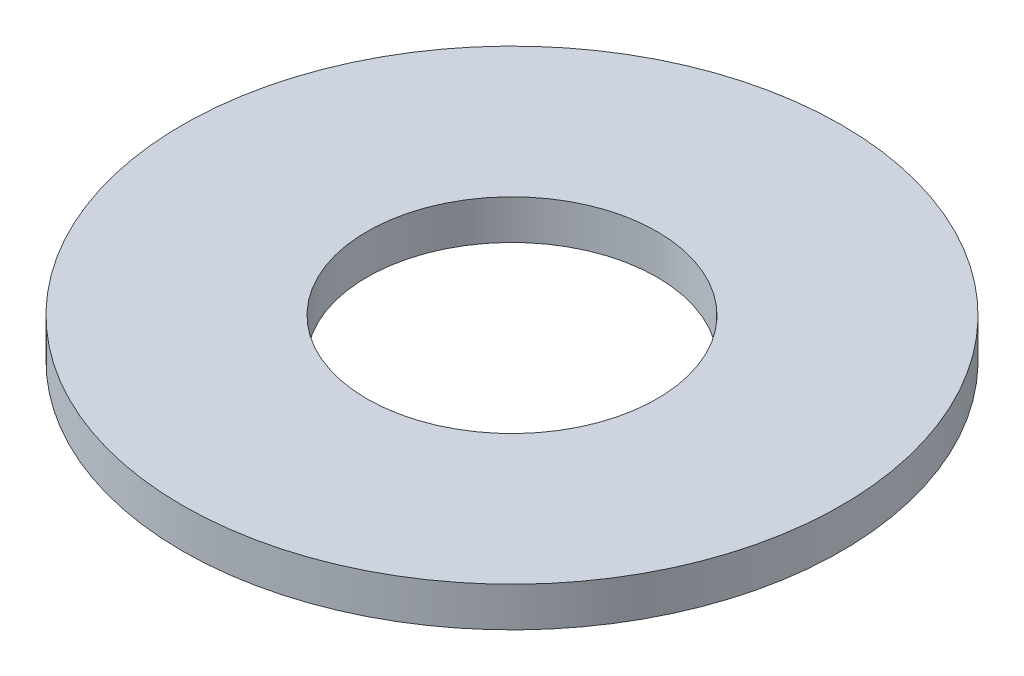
from build123d import *

# Parameters (mm, degrees)
SKETCH1_R      = 2.5
SKETCH1_R_2    = 1.1
EXTRUDE1_DEPTH = 0.3


with BuildPart() as part:
    # Sketch1 → Extrude1 (new body)
    with BuildSketch(Plane(origin=(0, 0, 0), x_dir=(1, 0, 0), z_dir=(0, 1, 0))):
        with Locations(Location((0, 0, 0), (0, 0, 270))):
            Circle(SKETCH1_R)
        with Locations(Location((0, 0, 0), (0, 0, 270))):
            Circle(SKETCH1_R_2, mode=Mode.SUBTRACT)
    extrude(amount=EXTRUDE1_DEPTH)


solid = part.part
